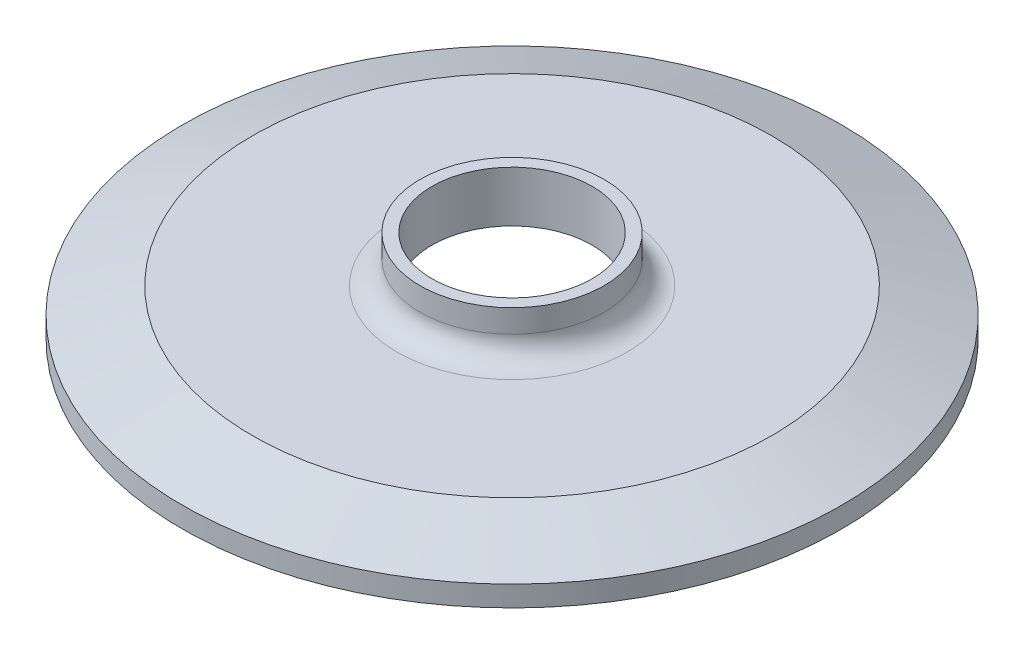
from build123d import *


with BuildPart() as part:
    # Sketch1 → Revolve1 (revolve)
    with BuildSketch(Plane.XY, mode=Mode.PRIVATE) as revolve1_sk:
        with BuildLine():
            Line((-12.7, 12.7), (-12.7, 9.525))
            ThreePointArc((-12.7, 9.525), (-13.62993597, 7.27993597), (-15.875, 6.35))
            Line((-15.875, 6.35), (-35.822842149, 6.35))
            Line((-35.822842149, 6.35), (-45.4533, 2.8448))
            Line((-45.4533, 2.8448), (-45.4533, 0))
            Line((-45.4533, 0), (-43.659272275, 0.002512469))
            ThreePointArc((-43.659272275, 0.002512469), (-43.224677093, 0.133310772), (-42.934466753, 0.482250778))
            Line((-42.934466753, 0.482250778), (-42.767598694, 0.87536729))
            ThreePointArc((-42.767598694, 0.87536729), (-41.6687, 1.602712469), (-40.569801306, 0.87536729))
            Line((-40.569801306, 0.87536729), (-40.402933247, 0.482250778))
            ThreePointArc((-40.402933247, 0.482250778), (-40.112722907, 0.133310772), (-39.678127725, 0.002512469))
            Line((-39.678127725, 0.002512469), (-36.449, 0))
            Line((-36.449, 0), (-11.049, 5.677572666))
            Line((-11.049, 5.677572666), (-11.049, 12.7))
            Line((-11.049, 12.7), (-12.7, 12.7))
        make_face()
    revolve(revolve1_sk.sketch.rotate(Axis((0, 0, 0), (0, 1, 0)), 270), axis=Axis((0, 0, 0), (0, 1, 0)))


solid = part.part
